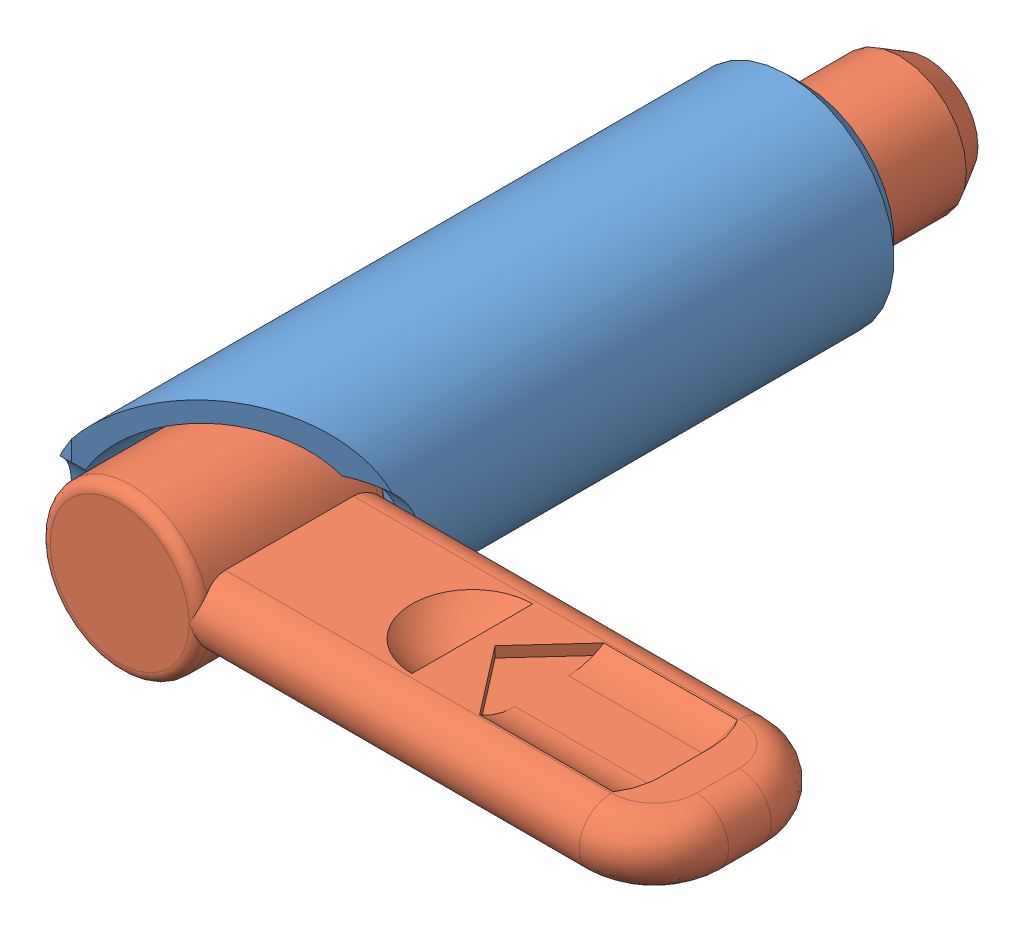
SolidWorks assembly GDX16L-10N-SUS.sldasm, configuration Default (file format 15000). Lengths in mm.
Overall size (48.01 16.01 61.21).
2 component instances, 2 part files, 0 mates.
Components (placement in the parent):
- GDX16L-10N-SUS_01-1: GDX16L-10N-SUS_01.SLDPRT [ﾃﾞﾌｫﾙﾄ] x (1 0 0) z (0 -1 0) size (16.02 50.53 16.01)
- GDX16L-10N-SUS_02-1: GDX16L-10N-SUS_02.SLDPRT [ﾃﾞﾌｫﾙﾄ] x (1 0 0) z (0 -1 0) size (46 61.21 12)
